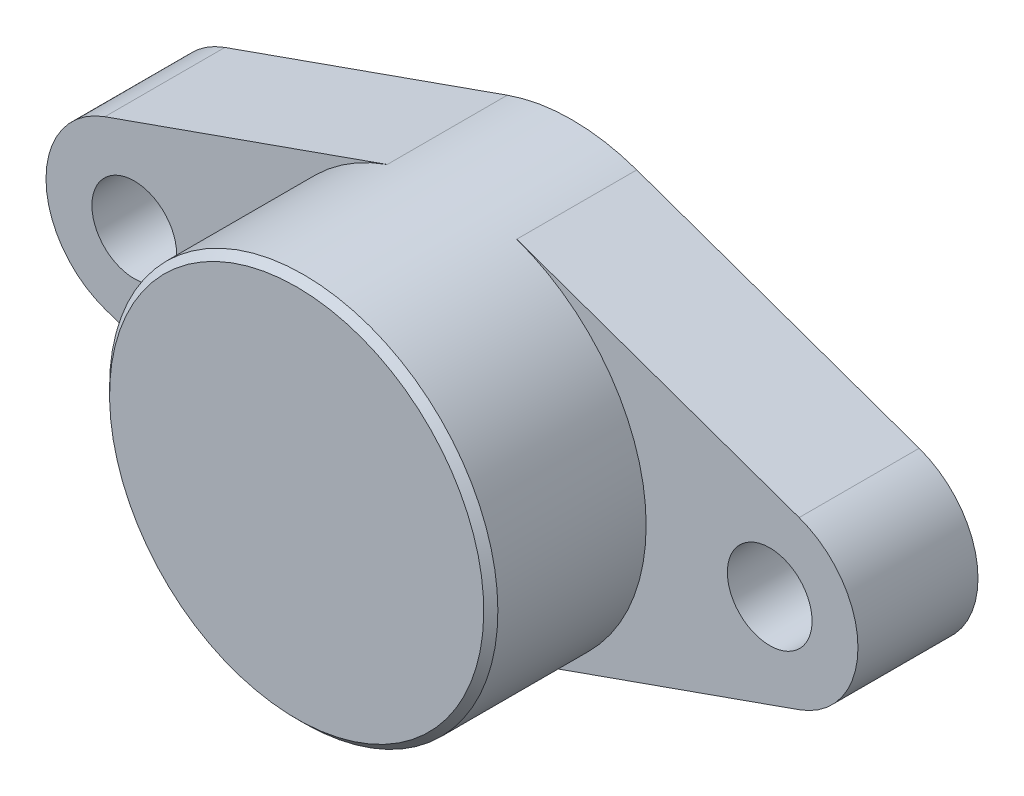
ISO-10303-21;
HEADER;
FILE_DESCRIPTION(('STEP AP214'),'2;1');
FILE_NAME('part.step','',(''),(''),'','','');
FILE_SCHEMA(('AUTOMOTIVE_DESIGN { 1 0 10303 214 1 1 1 1 }'));
ENDSEC;
DATA;
#1=APPLICATION_CONTEXT('core data for automotive mechanical design processes');
#2=APPLICATION_PROTOCOL_DEFINITION('international standard','automotive_design',2000,#1);
#3=PRODUCT_CONTEXT('',#1,'mechanical');
#4=PRODUCT('Part','Part','',(#3));
#5=PRODUCT_RELATED_PRODUCT_CATEGORY('part','',(#4));
#6=PRODUCT_DEFINITION_FORMATION('','',#4);
#7=PRODUCT_DEFINITION_CONTEXT('part definition',#1,'design');
#8=PRODUCT_DEFINITION('design','',#6,#7);
#9=PRODUCT_DEFINITION_SHAPE('','',#8);
#10=(LENGTH_UNIT() NAMED_UNIT(*) SI_UNIT(.MILLI.,.METRE.));
#11=(NAMED_UNIT(*) PLANE_ANGLE_UNIT() SI_UNIT($,.RADIAN.));
#12=(NAMED_UNIT(*) SI_UNIT($,.STERADIAN.) SOLID_ANGLE_UNIT());
#13=UNCERTAINTY_MEASURE_WITH_UNIT(LENGTH_MEASURE(1.E-05),#10,'distance_accuracy_value','');
#14=(GEOMETRIC_REPRESENTATION_CONTEXT(3) GLOBAL_UNCERTAINTY_ASSIGNED_CONTEXT((#13)) GLOBAL_UNIT_ASSIGNED_CONTEXT((#10,
#11,#12)) REPRESENTATION_CONTEXT('',''));
#15=CARTESIAN_POINT('',(0.,0.,0.));
#16=DIRECTION('',(0.,0.,1.));
#17=DIRECTION('',(1.,0.,0.));
#18=AXIS2_PLACEMENT_3D('',#15,#16,#17);
#19=CARTESIAN_POINT('',(0.,0.,17.));
#20=DIRECTION('',(0.,0.,1.));
#21=DIRECTION('',(0.,1.,0.));
#22=AXIS2_PLACEMENT_3D('',#19,#20,#21);
#23=PLANE('',#22);
#24=CARTESIAN_POINT('',(0.,0.,17.));
#25=DIRECTION('',(0.,0.,1.));
#26=DIRECTION('',(0.,1.,0.));
#27=AXIS2_PLACEMENT_3D('',#24,#25,#26);
#28=CIRCLE('',#27,6.);
#29=CARTESIAN_POINT('',(0.,6.,17.));
#30=VERTEX_POINT('',#29);
#31=EDGE_CURVE('E100',#30,#30,#28,.T.);
#32=ORIENTED_EDGE('',*,*,#31,.F.);
#33=EDGE_LOOP('',(#32));
#34=FACE_BOUND('',#33,.T.);
#35=CARTESIAN_POINT('',(45.,0.,17.));
#36=DIRECTION('',(0.,0.,1.));
#37=DIRECTION('',(0.,1.,0.));
#38=AXIS2_PLACEMENT_3D('',#35,#36,#37);
#39=CIRCLE('',#38,27.5);
#40=CARTESIAN_POINT('',(35.8333333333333,25.9272486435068,17.));
#41=VERTEX_POINT('',#40);
#42=CARTESIAN_POINT('',(35.8333333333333,-25.9272486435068,17.));
#43=VERTEX_POINT('',#42);
#44=EDGE_CURVE('E91',#41,#43,#39,.T.);
#45=ORIENTED_EDGE('',*,*,#44,.F.);
#46=DIRECTION('',(0.942809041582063,0.333333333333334,0.));
#47=VECTOR('',#46,1.);
#48=CARTESIAN_POINT('',(-4.1666666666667,11.7851130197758,17.));
#49=LINE('',#48,#47);
#50=CARTESIAN_POINT('',(-4.1666666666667,11.7851130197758,17.));
#51=VERTEX_POINT('',#50);
#52=EDGE_CURVE('E78',#51,#41,#49,.T.);
#53=ORIENTED_EDGE('',*,*,#52,.F.);
#54=CARTESIAN_POINT('',(0.,0.,17.));
#55=DIRECTION('',(0.,0.,1.));
#56=DIRECTION('',(0.,1.,0.));
#57=AXIS2_PLACEMENT_3D('',#54,#55,#56);
#58=CIRCLE('',#57,12.5);
#59=CARTESIAN_POINT('',(-4.1666666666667,-11.7851130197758,17.));
#60=VERTEX_POINT('',#59);
#61=EDGE_CURVE('E146',#51,#60,#58,.T.);
#62=ORIENTED_EDGE('',*,*,#61,.T.);
#63=DIRECTION('',(0.942809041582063,-0.333333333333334,0.));
#64=VECTOR('',#63,1.);
#65=CARTESIAN_POINT('',(-4.1666666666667,-11.7851130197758,17.));
#66=LINE('',#65,#64);
#67=EDGE_CURVE('E98',#60,#43,#66,.T.);
#68=ORIENTED_EDGE('',*,*,#67,.T.);
#69=EDGE_LOOP('',(#45,#53,#62,#68));
#70=FACE_BOUND('',#69,.T.);
#71=ADVANCED_FACE('F14',(#34,#70),#23,.T.);
#72=CARTESIAN_POINT('',(90.,0.,17.));
#73=DIRECTION('',(0.,0.,1.));
#74=DIRECTION('',(0.,1.,0.));
#75=AXIS2_PLACEMENT_3D('',#72,#73,#74);
#76=CIRCLE('',#75,6.);
#77=CARTESIAN_POINT('',(90.,6.,17.));
#78=VERTEX_POINT('',#77);
#79=EDGE_CURVE('E247',#78,#78,#76,.T.);
#80=ORIENTED_EDGE('',*,*,#79,.F.);
#81=EDGE_LOOP('',(#80));
#82=FACE_BOUND('',#81,.T.);
#83=CARTESIAN_POINT('',(54.1666666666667,-25.9272486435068,17.));
#84=VERTEX_POINT('',#83);
#85=CARTESIAN_POINT('',(54.1666666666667,25.9272486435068,17.));
#86=VERTEX_POINT('',#85);
#87=EDGE_CURVE('E118',#84,#86,#39,.T.);
#88=ORIENTED_EDGE('',*,*,#87,.F.);
#89=DIRECTION('',(0.942809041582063,0.333333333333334,0.));
#90=VECTOR('',#89,1.);
#91=CARTESIAN_POINT('',(54.1666666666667,-25.9272486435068,17.));
#92=LINE('',#91,#90);
#93=CARTESIAN_POINT('',(94.1666666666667,-11.7851130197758,17.));
#94=VERTEX_POINT('',#93);
#95=EDGE_CURVE('E137',#84,#94,#92,.T.);
#96=ORIENTED_EDGE('',*,*,#95,.T.);
#97=CARTESIAN_POINT('',(90.,0.,17.));
#98=DIRECTION('',(0.,0.,-1.));
#99=DIRECTION('',(0.,-1.,0.));
#100=AXIS2_PLACEMENT_3D('',#97,#98,#99);
#101=CIRCLE('',#100,12.5);
#102=CARTESIAN_POINT('',(94.1666666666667,11.7851130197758,17.));
#103=VERTEX_POINT('',#102);
#104=EDGE_CURVE('E128',#103,#94,#101,.T.);
#105=ORIENTED_EDGE('',*,*,#104,.F.);
#106=DIRECTION('',(0.942809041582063,-0.333333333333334,0.));
#107=VECTOR('',#106,1.);
#108=CARTESIAN_POINT('',(54.1666666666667,25.9272486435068,17.));
#109=LINE('',#108,#107);
#110=EDGE_CURVE('E86',#86,#103,#109,.T.);
#111=ORIENTED_EDGE('',*,*,#110,.F.);
#112=EDGE_LOOP('',(#88,#96,#105,#111));
#113=FACE_BOUND('',#112,.T.);
#114=ADVANCED_FACE('F170',(#82,#113),#23,.T.);
#115=CARTESIAN_POINT('',(0.,0.,0.));
#116=DIRECTION('',(0.,0.,1.));
#117=DIRECTION('',(0.,1.,0.));
#118=AXIS2_PLACEMENT_3D('',#115,#116,#117);
#119=PLANE('',#118);
#120=CARTESIAN_POINT('',(90.,0.,0.));
#121=DIRECTION('',(0.,0.,-1.));
#122=DIRECTION('',(0.,1.,0.));
#123=AXIS2_PLACEMENT_3D('',#120,#121,#122);
#124=CIRCLE('',#123,6.);
#125=CARTESIAN_POINT('',(90.,6.,0.));
#126=VERTEX_POINT('',#125);
#127=EDGE_CURVE('E243',#126,#126,#124,.T.);
#128=ORIENTED_EDGE('',*,*,#127,.F.);
#129=EDGE_LOOP('',(#128));
#130=FACE_BOUND('',#129,.T.);
#131=CARTESIAN_POINT('',(0.,0.,0.));
#132=DIRECTION('',(0.,0.,-1.));
#133=DIRECTION('',(0.,-1.,0.));
#134=AXIS2_PLACEMENT_3D('',#131,#132,#133);
#135=CIRCLE('',#134,6.);
#136=CARTESIAN_POINT('',(0.,-6.,0.));
#137=VERTEX_POINT('',#136);
#138=EDGE_CURVE('E106',#137,#137,#135,.T.);
#139=ORIENTED_EDGE('',*,*,#138,.F.);
#140=EDGE_LOOP('',(#139));
#141=FACE_BOUND('',#140,.T.);
#142=CARTESIAN_POINT('',(0.,0.,0.));
#143=DIRECTION('',(0.,0.,1.));
#144=DIRECTION('',(0.,1.,0.));
#145=AXIS2_PLACEMENT_3D('',#142,#143,#144);
#146=CIRCLE('',#145,12.5);
#147=CARTESIAN_POINT('',(-4.1666666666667,11.7851130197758,0.));
#148=VERTEX_POINT('',#147);
#149=CARTESIAN_POINT('',(-4.1666666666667,-11.7851130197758,0.));
#150=VERTEX_POINT('',#149);
#151=EDGE_CURVE('E99',#148,#150,#146,.T.);
#152=ORIENTED_EDGE('',*,*,#151,.F.);
#153=DIRECTION('',(0.942809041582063,0.333333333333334,0.));
#154=VECTOR('',#153,1.);
#155=CARTESIAN_POINT('',(-4.1666666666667,11.7851130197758,0.));
#156=LINE('',#155,#154);
#157=CARTESIAN_POINT('',(35.8333333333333,25.9272486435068,0.));
#158=VERTEX_POINT('',#157);
#159=EDGE_CURVE('E227',#148,#158,#156,.T.);
#160=ORIENTED_EDGE('',*,*,#159,.T.);
#161=CARTESIAN_POINT('',(45.,0.,0.));
#162=DIRECTION('',(0.,0.,1.));
#163=DIRECTION('',(0.,1.,0.));
#164=AXIS2_PLACEMENT_3D('',#161,#162,#163);
#165=CIRCLE('',#164,27.5);
#166=CARTESIAN_POINT('',(54.1666666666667,25.9272486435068,0.));
#167=VERTEX_POINT('',#166);
#168=EDGE_CURVE('E93',#167,#158,#165,.T.);
#169=ORIENTED_EDGE('',*,*,#168,.F.);
#170=DIRECTION('',(0.942809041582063,-0.333333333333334,0.));
#171=VECTOR('',#170,1.);
#172=CARTESIAN_POINT('',(54.1666666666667,25.9272486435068,0.));
#173=LINE('',#172,#171);
#174=CARTESIAN_POINT('',(94.1666666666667,11.7851130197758,0.));
#175=VERTEX_POINT('',#174);
#176=EDGE_CURVE('E221',#167,#175,#173,.T.);
#177=ORIENTED_EDGE('',*,*,#176,.T.);
#178=CARTESIAN_POINT('',(90.,0.,0.));
#179=DIRECTION('',(0.,0.,-1.));
#180=DIRECTION('',(0.,-1.,0.));
#181=AXIS2_PLACEMENT_3D('',#178,#179,#180);
#182=CIRCLE('',#181,12.5);
#183=CARTESIAN_POINT('',(94.1666666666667,-11.7851130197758,0.));
#184=VERTEX_POINT('',#183);
#185=EDGE_CURVE('E222',#175,#184,#182,.T.);
#186=ORIENTED_EDGE('',*,*,#185,.T.);
#187=DIRECTION('',(0.942809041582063,0.333333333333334,0.));
#188=VECTOR('',#187,1.);
#189=CARTESIAN_POINT('',(54.1666666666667,-25.9272486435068,0.));
#190=LINE('',#189,#188);
#191=CARTESIAN_POINT('',(54.1666666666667,-25.9272486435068,0.));
#192=VERTEX_POINT('',#191);
#193=EDGE_CURVE('E208',#192,#184,#190,.T.);
#194=ORIENTED_EDGE('',*,*,#193,.F.);
#195=CARTESIAN_POINT('',(35.8333333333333,-25.9272486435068,0.));
#196=VERTEX_POINT('',#195);
#197=EDGE_CURVE('E229',#196,#192,#165,.T.);
#198=ORIENTED_EDGE('',*,*,#197,.F.);
#199=DIRECTION('',(0.942809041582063,-0.333333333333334,0.));
#200=VECTOR('',#199,1.);
#201=CARTESIAN_POINT('',(-4.1666666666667,-11.7851130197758,0.));
#202=LINE('',#201,#200);
#203=EDGE_CURVE('E103',#150,#196,#202,.T.);
#204=ORIENTED_EDGE('',*,*,#203,.F.);
#205=EDGE_LOOP('',(#152,#160,#169,#177,#186,#194,#198,#204));
#206=FACE_BOUND('',#205,.T.);
#207=ADVANCED_FACE('F177',(#130,#141,#206),#119,.F.);
#208=CARTESIAN_POINT('',(0.,0.,17.));
#209=DIRECTION('',(0.,0.,-1.));
#210=DIRECTION('',(0.,-1.,0.));
#211=AXIS2_PLACEMENT_3D('',#208,#209,#210);
#212=CYLINDRICAL_SURFACE('',#211,12.5);
#213=DIRECTION('',(0.,0.,-1.));
#214=VECTOR('',#213,1.);
#215=CARTESIAN_POINT('',(-4.1666666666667,-11.7851130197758,17.));
#216=LINE('',#215,#214);
#217=EDGE_CURVE('E113',#60,#150,#216,.T.);
#218=ORIENTED_EDGE('',*,*,#217,.F.);
#219=ORIENTED_EDGE('',*,*,#61,.F.);
#220=DIRECTION('',(0.,0.,-1.));
#221=VECTOR('',#220,1.);
#222=CARTESIAN_POINT('',(-4.1666666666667,11.7851130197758,17.));
#223=LINE('',#222,#221);
#224=EDGE_CURVE('E29',#51,#148,#223,.T.);
#225=ORIENTED_EDGE('',*,*,#224,.T.);
#226=ORIENTED_EDGE('',*,*,#151,.T.);
#227=EDGE_LOOP('',(#218,#219,#225,#226));
#228=FACE_BOUND('',#227,.T.);
#229=ADVANCED_FACE('F182',(#228),#212,.T.);
#230=CARTESIAN_POINT('',(-4.1666666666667,-11.7851130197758,17.));
#231=DIRECTION('',(0.333333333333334,0.942809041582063,0.));
#232=DIRECTION('',(-0.942809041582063,0.333333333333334,0.));
#233=AXIS2_PLACEMENT_3D('',#230,#231,#232);
#234=PLANE('',#233);
#235=DIRECTION('',(0.,0.,-1.));
#236=VECTOR('',#235,1.);
#237=CARTESIAN_POINT('',(35.8333333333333,-25.9272486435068,17.));
#238=LINE('',#237,#236);
#239=EDGE_CURVE('E133',#43,#196,#238,.T.);
#240=ORIENTED_EDGE('',*,*,#239,.F.);
#241=ORIENTED_EDGE('',*,*,#67,.F.);
#242=ORIENTED_EDGE('',*,*,#217,.T.);
#243=ORIENTED_EDGE('',*,*,#203,.T.);
#244=EDGE_LOOP('',(#240,#241,#242,#243));
#245=FACE_BOUND('',#244,.T.);
#246=ADVANCED_FACE('F16',(#245),#234,.F.);
#247=CARTESIAN_POINT('',(54.1666666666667,-25.9272486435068,17.));
#248=DIRECTION('',(-0.333333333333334,0.942809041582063,0.));
#249=DIRECTION('',(-0.942809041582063,-0.333333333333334,0.));
#250=AXIS2_PLACEMENT_3D('',#247,#248,#249);
#251=PLANE('',#250);
#252=DIRECTION('',(0.,0.,-1.));
#253=VECTOR('',#252,1.);
#254=CARTESIAN_POINT('',(94.1666666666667,-11.7851130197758,17.));
#255=LINE('',#254,#253);
#256=EDGE_CURVE('E134',#94,#184,#255,.T.);
#257=ORIENTED_EDGE('',*,*,#256,.F.);
#258=ORIENTED_EDGE('',*,*,#95,.F.);
#259=DIRECTION('',(0.,0.,-1.));
#260=VECTOR('',#259,1.);
#261=CARTESIAN_POINT('',(54.1666666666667,-25.9272486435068,17.));
#262=LINE('',#261,#260);
#263=EDGE_CURVE('E131',#84,#192,#262,.T.);
#264=ORIENTED_EDGE('',*,*,#263,.T.);
#265=ORIENTED_EDGE('',*,*,#193,.T.);
#266=EDGE_LOOP('',(#257,#258,#264,#265));
#267=FACE_BOUND('',#266,.T.);
#268=ADVANCED_FACE('F196',(#267),#251,.F.);
#269=CARTESIAN_POINT('',(90.,0.,17.));
#270=DIRECTION('',(0.,0.,-1.));
#271=DIRECTION('',(0.,-1.,0.));
#272=AXIS2_PLACEMENT_3D('',#269,#270,#271);
#273=CYLINDRICAL_SURFACE('',#272,12.5);
#274=DIRECTION('',(0.,0.,-1.));
#275=VECTOR('',#274,1.);
#276=CARTESIAN_POINT('',(94.1666666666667,11.7851130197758,17.));
#277=LINE('',#276,#275);
#278=EDGE_CURVE('E124',#103,#175,#277,.T.);
#279=ORIENTED_EDGE('',*,*,#278,.F.);
#280=ORIENTED_EDGE('',*,*,#104,.T.);
#281=ORIENTED_EDGE('',*,*,#256,.T.);
#282=ORIENTED_EDGE('',*,*,#185,.F.);
#283=EDGE_LOOP('',(#279,#280,#281,#282));
#284=FACE_BOUND('',#283,.T.);
#285=ADVANCED_FACE('F194',(#284),#273,.T.);
#286=CARTESIAN_POINT('',(54.1666666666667,25.9272486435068,17.));
#287=DIRECTION('',(0.333333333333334,0.942809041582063,0.));
#288=DIRECTION('',(-0.942809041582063,0.333333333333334,0.));
#289=AXIS2_PLACEMENT_3D('',#286,#287,#288);
#290=PLANE('',#289);
#291=DIRECTION('',(0.,0.,-1.));
#292=VECTOR('',#291,1.);
#293=CARTESIAN_POINT('',(54.1666666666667,25.9272486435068,17.));
#294=LINE('',#293,#292);
#295=EDGE_CURVE('E37',#86,#167,#294,.T.);
#296=ORIENTED_EDGE('',*,*,#295,.F.);
#297=ORIENTED_EDGE('',*,*,#110,.T.);
#298=ORIENTED_EDGE('',*,*,#278,.T.);
#299=ORIENTED_EDGE('',*,*,#176,.F.);
#300=EDGE_LOOP('',(#296,#297,#298,#299));
#301=FACE_BOUND('',#300,.T.);
#302=ADVANCED_FACE('F190',(#301),#290,.T.);
#303=CARTESIAN_POINT('',(45.,0.,17.));
#304=DIRECTION('',(0.,0.,-1.));
#305=DIRECTION('',(0.,-1.,0.));
#306=AXIS2_PLACEMENT_3D('',#303,#304,#305);
#307=CYLINDRICAL_SURFACE('',#306,27.5);
#308=CARTESIAN_POINT('',(45.,0.,38.));
#309=DIRECTION('',(0.,0.,1.));
#310=DIRECTION('',(0.,1.,0.));
#311=AXIS2_PLACEMENT_3D('',#308,#309,#310);
#312=CIRCLE('',#311,27.5);
#313=CARTESIAN_POINT('',(45.,27.5,38.));
#314=VERTEX_POINT('',#313);
#315=EDGE_CURVE('E9',#314,#314,#312,.F.);
#316=ORIENTED_EDGE('',*,*,#315,.T.);
#317=EDGE_LOOP('',(#316));
#318=FACE_BOUND('',#317,.T.);
#319=DIRECTION('',(0.,0.,-1.));
#320=VECTOR('',#319,1.);
#321=CARTESIAN_POINT('',(35.8333333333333,25.9272486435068,17.));
#322=LINE('',#321,#320);
#323=EDGE_CURVE('E81',#41,#158,#322,.T.);
#324=ORIENTED_EDGE('',*,*,#323,.F.);
#325=ORIENTED_EDGE('',*,*,#44,.T.);
#326=ORIENTED_EDGE('',*,*,#239,.T.);
#327=ORIENTED_EDGE('',*,*,#197,.T.);
#328=ORIENTED_EDGE('',*,*,#263,.F.);
#329=ORIENTED_EDGE('',*,*,#87,.T.);
#330=ORIENTED_EDGE('',*,*,#295,.T.);
#331=ORIENTED_EDGE('',*,*,#168,.T.);
#332=EDGE_LOOP('',(#324,#325,#326,#327,#328,#329,#330,#331));
#333=FACE_BOUND('',#332,.T.);
#334=ADVANCED_FACE('F90',(#318,#333),#307,.T.);
#335=CARTESIAN_POINT('',(-4.1666666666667,11.7851130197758,17.));
#336=DIRECTION('',(-0.333333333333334,0.942809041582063,0.));
#337=DIRECTION('',(-0.942809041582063,-0.333333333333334,0.));
#338=AXIS2_PLACEMENT_3D('',#335,#336,#337);
#339=PLANE('',#338);
#340=ORIENTED_EDGE('',*,*,#52,.T.);
#341=ORIENTED_EDGE('',*,*,#323,.T.);
#342=ORIENTED_EDGE('',*,*,#159,.F.);
#343=ORIENTED_EDGE('',*,*,#224,.F.);
#344=EDGE_LOOP('',(#340,#341,#342,#343));
#345=FACE_BOUND('',#344,.T.);
#346=ADVANCED_FACE('F80',(#345),#339,.T.);
#347=CARTESIAN_POINT('',(45.,0.,39.));
#348=DIRECTION('',(0.,0.,1.));
#349=DIRECTION('',(0.,1.,0.));
#350=AXIS2_PLACEMENT_3D('',#347,#348,#349);
#351=PLANE('',#350);
#352=CARTESIAN_POINT('',(45.,0.,39.));
#353=DIRECTION('',(0.,0.,1.));
#354=DIRECTION('',(0.,1.,0.));
#355=AXIS2_PLACEMENT_3D('',#352,#353,#354);
#356=CIRCLE('',#355,26.5);
#357=CARTESIAN_POINT('',(45.,26.5,39.));
#358=VERTEX_POINT('',#357);
#359=EDGE_CURVE('E22',#358,#358,#356,.T.);
#360=ORIENTED_EDGE('',*,*,#359,.T.);
#361=EDGE_LOOP('',(#360));
#362=FACE_BOUND('',#361,.T.);
#363=ADVANCED_FACE('F151',(#362),#351,.T.);
#364=CARTESIAN_POINT('',(45.,0.,39.));
#365=DIRECTION('',(0.,0.,-1.));
#366=DIRECTION('',(0.,-1.,0.));
#367=AXIS2_PLACEMENT_3D('',#364,#365,#366);
#368=CONICAL_SURFACE('',#367,26.5,0.785398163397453);
#369=ORIENTED_EDGE('',*,*,#315,.F.);
#370=EDGE_LOOP('',(#369));
#371=FACE_BOUND('',#370,.T.);
#372=ORIENTED_EDGE('',*,*,#359,.F.);
#373=EDGE_LOOP('',(#372));
#374=FACE_BOUND('',#373,.T.);
#375=ADVANCED_FACE('F153',(#371,#374),#368,.T.);
#376=CARTESIAN_POINT('',(0.,0.,39.));
#377=DIRECTION('',(0.,0.,-1.));
#378=DIRECTION('',(0.,-1.,0.));
#379=AXIS2_PLACEMENT_3D('',#376,#377,#378);
#380=CYLINDRICAL_SURFACE('',#379,6.);
#381=ORIENTED_EDGE('',*,*,#31,.T.);
#382=EDGE_LOOP('',(#381));
#383=FACE_BOUND('',#382,.T.);
#384=ORIENTED_EDGE('',*,*,#138,.T.);
#385=EDGE_LOOP('',(#384));
#386=FACE_BOUND('',#385,.T.);
#387=ADVANCED_FACE('F155',(#383,#386),#380,.F.);
#388=CARTESIAN_POINT('',(90.,0.,39.));
#389=DIRECTION('',(0.,0.,-1.));
#390=DIRECTION('',(0.,-1.,0.));
#391=AXIS2_PLACEMENT_3D('',#388,#389,#390);
#392=CYLINDRICAL_SURFACE('',#391,6.);
#393=ORIENTED_EDGE('',*,*,#79,.T.);
#394=EDGE_LOOP('',(#393));
#395=FACE_BOUND('',#394,.T.);
#396=ORIENTED_EDGE('',*,*,#127,.T.);
#397=EDGE_LOOP('',(#396));
#398=FACE_BOUND('',#397,.T.);
#399=ADVANCED_FACE('F164',(#395,#398),#392,.F.);
#400=CLOSED_SHELL('',(#71,#114,#207,#229,#246,#268,#285,#302,#334,#346,#363,#375,#387,#399));
#401=MANIFOLD_SOLID_BREP('B1',#400);
#402=ADVANCED_BREP_SHAPE_REPRESENTATION('',(#18,#401),#14);
#403=SHAPE_DEFINITION_REPRESENTATION(#9,#402);
ENDSEC;
END-ISO-10303-21;
